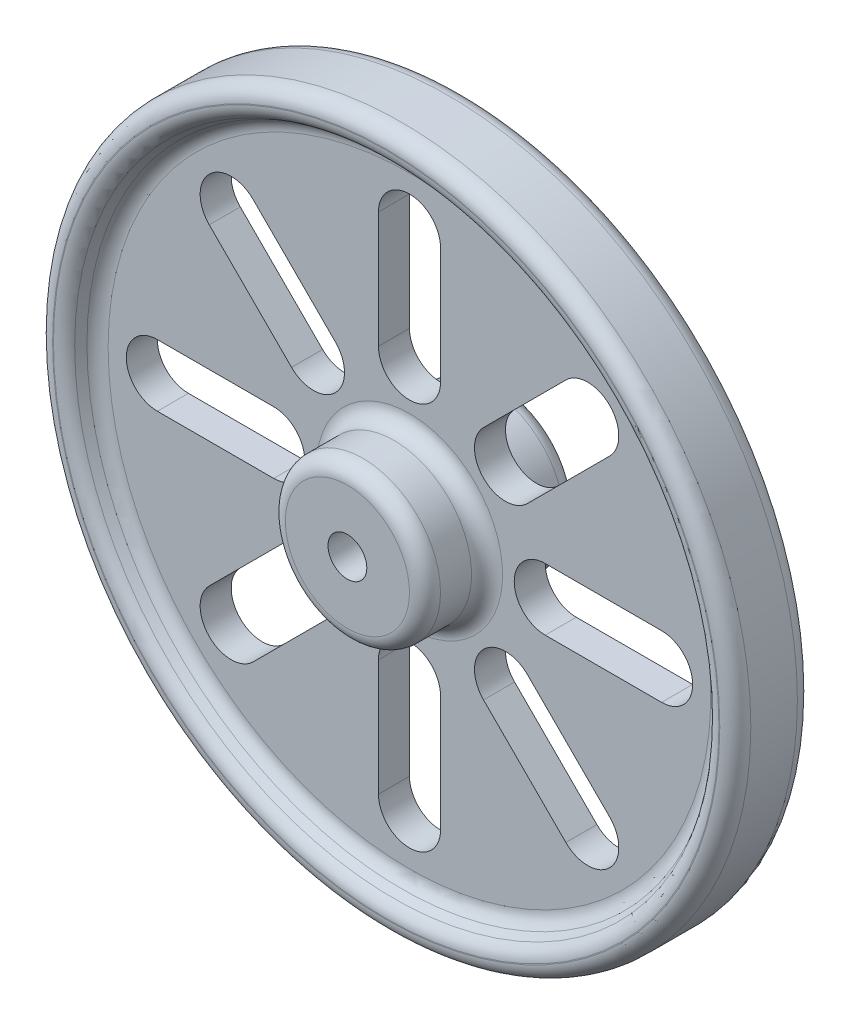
from build123d import *

# Parameters (mm, degrees)
SKETCH1_R                = 10
BOSS_EXTRUDE1_DEPTH      = 10
CUT_EXTRUDE1_DEPTH       = 65.761099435
CIRPATTERN1_COUNT        = 8
F_5_0_5_DIAMETER_HOLE1_D = 5
FILLET1_R                = 2


with BuildPart() as part:
    # Sketch1 → Boss-Extrude1 (new, symmetric)
    with BuildSketch(Plane.XY):
        Circle(SKETCH1_R)
    extrude(amount=BOSS_EXTRUDE1_DEPTH, both=True)

    # Sketch2 → Revolve1 (revolve)
    with BuildSketch(Plane(origin=(0, 0, 0), x_dir=(0, 0, -1), z_dir=(1, 0, 0)), mode=Mode.PRIVATE) as revolve1_sk:
        Polygon((-2, 10), (2, 10), (2, 40), (5, 41.732050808), (5, 45), (-5, 45), (-5, 41.732050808), (-2, 40), align=None)
    revolve(revolve1_sk.sketch.rotate(Axis((0, 0, 10), (0, 0, -1)), 90), axis=Axis((0, 0, 10), (0, 0, -1)))

    # Sketch3 → Cut-Extrude1 (cut, through all)
    with BuildSketch(Plane.XY.offset(2)):
        with BuildLine():
            Line((-4, 17.5), (-4, 32.5))
            ThreePointArc((-4, 32.5), (0, 36.5), (4, 32.5))
            Line((4, 32.5), (4, 17.5))
            ThreePointArc((4, 17.5), (0, 13.5), (-4, 17.5))
        make_face()
    cut_extrude1 = extrude(amount=-CUT_EXTRUDE1_DEPTH, mode=Mode.SUBTRACT)

    # CirPattern1: Cut-Extrude1 ×8 about axis
    cirpattern1_axis = Axis((0, 0, 0), (0, 0, 1))
    for i in range(1, CIRPATTERN1_COUNT):
        add(cut_extrude1.rotate(cirpattern1_axis, i * 360 / CIRPATTERN1_COUNT), mode=Mode.SUBTRACT)

    # 5.0 _5_ Diameter Hole1 (through all)
    with Locations(Plane.XY.offset(10)):
        with Locations((0, 0)):
            Hole(F_5_0_5_DIAMETER_HOLE1_D / 2)

    # Fillet1
    fillet1_edges = [part.edges().sort_by_distance(p)[0] for p in [
        (-10, 0, -10),
        (-10, 0, 10),
        (-10, 0, -2),
        (-10, 0, 2),
        (-45, 0, 5),
        (-41.732050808, 0, 5),
        (-40, 0, 2),
        (-40, 0, -2),
        (-41.732050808, 0, -5),
        (-45, 0, -5),
    ]]
    fillet(fillet1_edges, radius=FILLET1_R)


solid = part.part
